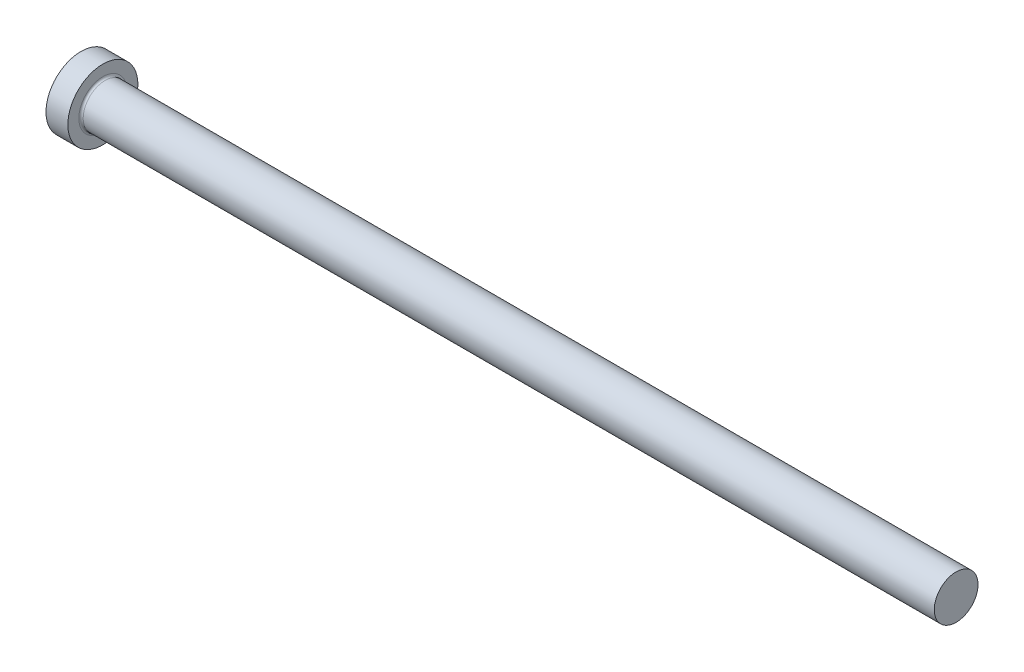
ISO-10303-21;
HEADER;
FILE_DESCRIPTION(('STEP AP214'),'2;1');
FILE_NAME('part.step','',(''),(''),'','','');
FILE_SCHEMA(('AUTOMOTIVE_DESIGN { 1 0 10303 214 1 1 1 1 }'));
ENDSEC;
DATA;
#1=APPLICATION_CONTEXT('core data for automotive mechanical design processes');
#2=APPLICATION_PROTOCOL_DEFINITION('international standard','automotive_design',2000,#1);
#3=PRODUCT_CONTEXT('',#1,'mechanical');
#4=PRODUCT('Part','Part','',(#3));
#5=PRODUCT_RELATED_PRODUCT_CATEGORY('part','',(#4));
#6=PRODUCT_DEFINITION_FORMATION('','',#4);
#7=PRODUCT_DEFINITION_CONTEXT('part definition',#1,'design');
#8=PRODUCT_DEFINITION('design','',#6,#7);
#9=PRODUCT_DEFINITION_SHAPE('','',#8);
#10=(LENGTH_UNIT() NAMED_UNIT(*) SI_UNIT(.MILLI.,.METRE.));
#11=(NAMED_UNIT(*) PLANE_ANGLE_UNIT() SI_UNIT($,.RADIAN.));
#12=(NAMED_UNIT(*) SI_UNIT($,.STERADIAN.) SOLID_ANGLE_UNIT());
#13=UNCERTAINTY_MEASURE_WITH_UNIT(LENGTH_MEASURE(1.E-05),#10,'distance_accuracy_value','');
#14=(GEOMETRIC_REPRESENTATION_CONTEXT(3) GLOBAL_UNCERTAINTY_ASSIGNED_CONTEXT((#13)) GLOBAL_UNIT_ASSIGNED_CONTEXT((#10,
#11,#12)) REPRESENTATION_CONTEXT('',''));
#15=CARTESIAN_POINT('',(0.,0.,0.));
#16=DIRECTION('',(0.,0.,1.));
#17=DIRECTION('',(1.,0.,0.));
#18=AXIS2_PLACEMENT_3D('',#15,#16,#17);
#19=CARTESIAN_POINT('',(0.,0.,0.));
#20=DIRECTION('',(-1.,0.,0.));
#21=DIRECTION('',(0.,-1.,0.));
#22=AXIS2_PLACEMENT_3D('',#19,#20,#21);
#23=PLANE('',#22);
#24=CARTESIAN_POINT('',(0.,0.,0.));
#25=DIRECTION('',(1.,0.,0.));
#26=DIRECTION('',(0.,1.,0.));
#27=AXIS2_PLACEMENT_3D('',#24,#25,#26);
#28=CIRCLE('',#27,8.);
#29=CARTESIAN_POINT('',(0.,8.,0.));
#30=VERTEX_POINT('',#29);
#31=EDGE_CURVE('E24',#30,#30,#28,.T.);
#32=ORIENTED_EDGE('',*,*,#31,.F.);
#33=EDGE_LOOP('',(#32));
#34=FACE_BOUND('',#33,.T.);
#35=ADVANCED_FACE('F13',(#34),#23,.T.);
#36=CARTESIAN_POINT('',(200.,0.,0.));
#37=DIRECTION('',(1.,0.,0.));
#38=DIRECTION('',(0.,1.,0.));
#39=AXIS2_PLACEMENT_3D('',#36,#37,#38);
#40=CYLINDRICAL_SURFACE('',#39,8.);
#41=ORIENTED_EDGE('',*,*,#31,.T.);
#42=EDGE_LOOP('',(#41));
#43=FACE_BOUND('',#42,.T.);
#44=CARTESIAN_POINT('',(5.,0.,0.));
#45=DIRECTION('',(1.,0.,0.));
#46=DIRECTION('',(0.,1.,0.));
#47=AXIS2_PLACEMENT_3D('',#44,#45,#46);
#48=CIRCLE('',#47,8.);
#49=CARTESIAN_POINT('',(5.,8.,0.));
#50=VERTEX_POINT('',#49);
#51=EDGE_CURVE('E28',#50,#50,#48,.T.);
#52=ORIENTED_EDGE('',*,*,#51,.F.);
#53=EDGE_LOOP('',(#52));
#54=FACE_BOUND('',#53,.T.);
#55=ADVANCED_FACE('F50',(#43,#54),#40,.T.);
#56=CARTESIAN_POINT('',(5.,8.,0.));
#57=DIRECTION('',(1.,0.,0.));
#58=DIRECTION('',(0.,1.,0.));
#59=AXIS2_PLACEMENT_3D('',#56,#57,#58);
#60=PLANE('',#59);
#61=CARTESIAN_POINT('',(5.,0.,0.));
#62=DIRECTION('',(1.,0.,0.));
#63=DIRECTION('',(0.,1.,0.));
#64=AXIS2_PLACEMENT_3D('',#61,#62,#63);
#65=CIRCLE('',#64,5.49999999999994);
#66=CARTESIAN_POINT('',(5.,5.49999999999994,0.));
#67=VERTEX_POINT('',#66);
#68=EDGE_CURVE('E8',#67,#67,#65,.F.);
#69=ORIENTED_EDGE('',*,*,#68,.T.);
#70=EDGE_LOOP('',(#69));
#71=FACE_BOUND('',#70,.T.);
#72=ORIENTED_EDGE('',*,*,#51,.T.);
#73=EDGE_LOOP('',(#72));
#74=FACE_BOUND('',#73,.T.);
#75=ADVANCED_FACE('F41',(#71,#74),#60,.T.);
#76=CARTESIAN_POINT('',(200.,0.,0.));
#77=DIRECTION('',(1.,0.,0.));
#78=DIRECTION('',(0.,1.,0.));
#79=AXIS2_PLACEMENT_3D('',#76,#77,#78);
#80=CYLINDRICAL_SURFACE('',#79,4.99999999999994);
#81=CARTESIAN_POINT('',(5.5,0.,0.));
#82=DIRECTION('',(1.,0.,0.));
#83=DIRECTION('',(0.,1.,0.));
#84=AXIS2_PLACEMENT_3D('',#81,#82,#83);
#85=CIRCLE('',#84,4.99999999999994);
#86=CARTESIAN_POINT('',(5.5,4.99999999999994,0.));
#87=VERTEX_POINT('',#86);
#88=EDGE_CURVE('E20',#87,#87,#85,.T.);
#89=ORIENTED_EDGE('',*,*,#88,.T.);
#90=EDGE_LOOP('',(#89));
#91=FACE_BOUND('',#90,.T.);
#92=CARTESIAN_POINT('',(200.,0.,0.));
#93=DIRECTION('',(1.,0.,0.));
#94=DIRECTION('',(0.,1.,0.));
#95=AXIS2_PLACEMENT_3D('',#92,#93,#94);
#96=CIRCLE('',#95,5.);
#97=CARTESIAN_POINT('',(200.,5.00000000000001,0.));
#98=VERTEX_POINT('',#97);
#99=EDGE_CURVE('E33',#98,#98,#96,.T.);
#100=ORIENTED_EDGE('',*,*,#99,.F.);
#101=EDGE_LOOP('',(#100));
#102=FACE_BOUND('',#101,.T.);
#103=ADVANCED_FACE('F39',(#91,#102),#80,.T.);
#104=CARTESIAN_POINT('',(200.,5.,0.));
#105=DIRECTION('',(1.,0.,0.));
#106=DIRECTION('',(0.,1.,0.));
#107=AXIS2_PLACEMENT_3D('',#104,#105,#106);
#108=PLANE('',#107);
#109=ORIENTED_EDGE('',*,*,#99,.T.);
#110=EDGE_LOOP('',(#109));
#111=FACE_BOUND('',#110,.T.);
#112=ADVANCED_FACE('F37',(#111),#108,.T.);
#113=CARTESIAN_POINT('',(5.5,0.,0.));
#114=DIRECTION('',(1.,0.,0.));
#115=DIRECTION('',(0.,1.,0.));
#116=AXIS2_PLACEMENT_3D('',#113,#114,#115);
#117=TOROIDAL_SURFACE('',#116,5.49999999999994,0.5);
#118=ORIENTED_EDGE('',*,*,#68,.F.);
#119=EDGE_LOOP('',(#118));
#120=FACE_BOUND('',#119,.T.);
#121=ORIENTED_EDGE('',*,*,#88,.F.);
#122=EDGE_LOOP('',(#121));
#123=FACE_BOUND('',#122,.T.);
#124=ADVANCED_FACE('F15',(#120,#123),#117,.F.);
#125=CLOSED_SHELL('',(#35,#55,#75,#103,#112,#124));
#126=MANIFOLD_SOLID_BREP('B1',#125);
#127=ADVANCED_BREP_SHAPE_REPRESENTATION('',(#18,#126),#14);
#128=SHAPE_DEFINITION_REPRESENTATION(#9,#127);
ENDSEC;
END-ISO-10303-21;
